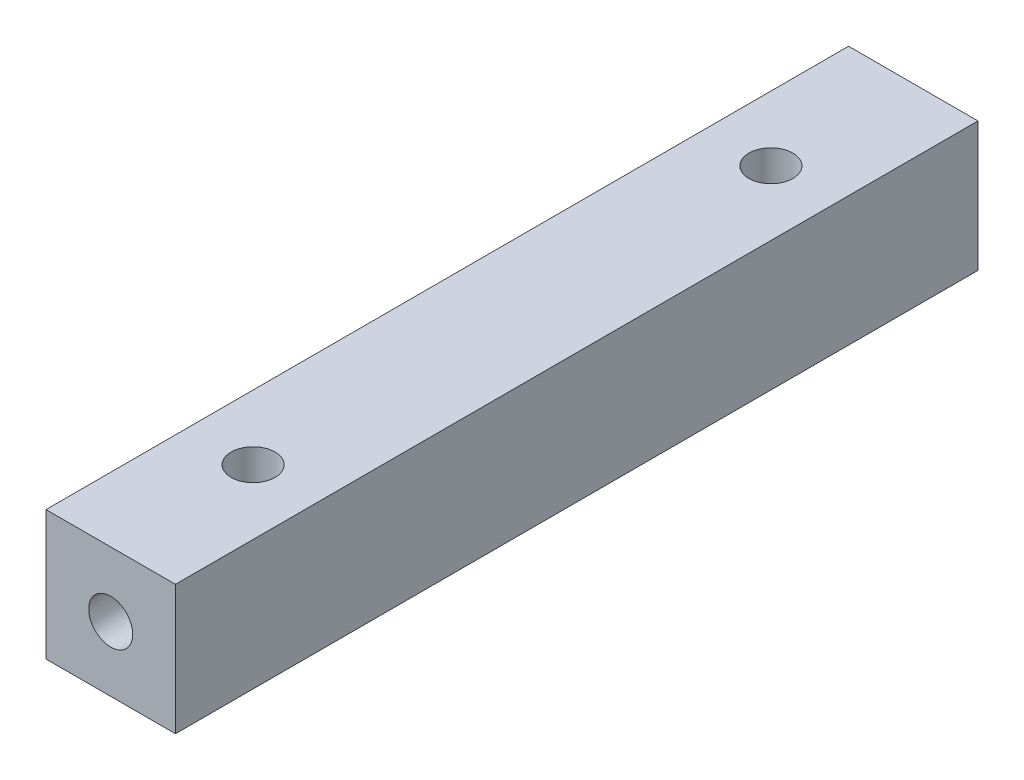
from build123d import *

# Parameters (mm, degrees)
ESQUISSE1_W       = 20
ESQUISSE1_H       = 20
EXTRUSION1_DEPTH  = 62
TROU_TARAUD_M82_D = 6.8


with BuildPart() as part:
    # Esquisse1 → Extrusion1 (new, symmetric)
    with BuildSketch(Plane.XY):
        with Locations((0, 10)):
            Rectangle(ESQUISSE1_W, ESQUISSE1_H)
    extrude(amount=EXTRUSION1_DEPTH, both=True)

    # Esquisse2 → Trou taraud_ M81 (revolve, cut)
    with BuildSketch(Plane(origin=(0, 10, 62), x_dir=(0, -1, 0), z_dir=(1, 0, 0))):
        Polygon((0, 0), (0, 24.292926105), (3.4, 22.25), (3.4, 0), align=None)
    trou_taraud_m81 = revolve(axis=Axis((0, 10, 68.35), (0, 0, -1)), mode=Mode.SUBTRACT)

    # Trou taraud_ M82 (through all)
    with Locations(Plane(origin=(0, 20, 0), x_dir=(-1, 0, 0), z_dir=(0, 1, 0))):
        with Locations((0, 40)):
            trou_taraud_m82 = Hole(TROU_TARAUD_M82_D / 2)

    # Sym_trie1: Trou taraud_ M81, Trou taraud_ M82 across plane
    add(trou_taraud_m81.mirror(Plane.XY), mode=Mode.SUBTRACT)
    add(trou_taraud_m82.mirror(Plane.XY), mode=Mode.SUBTRACT)


solid = part.part
